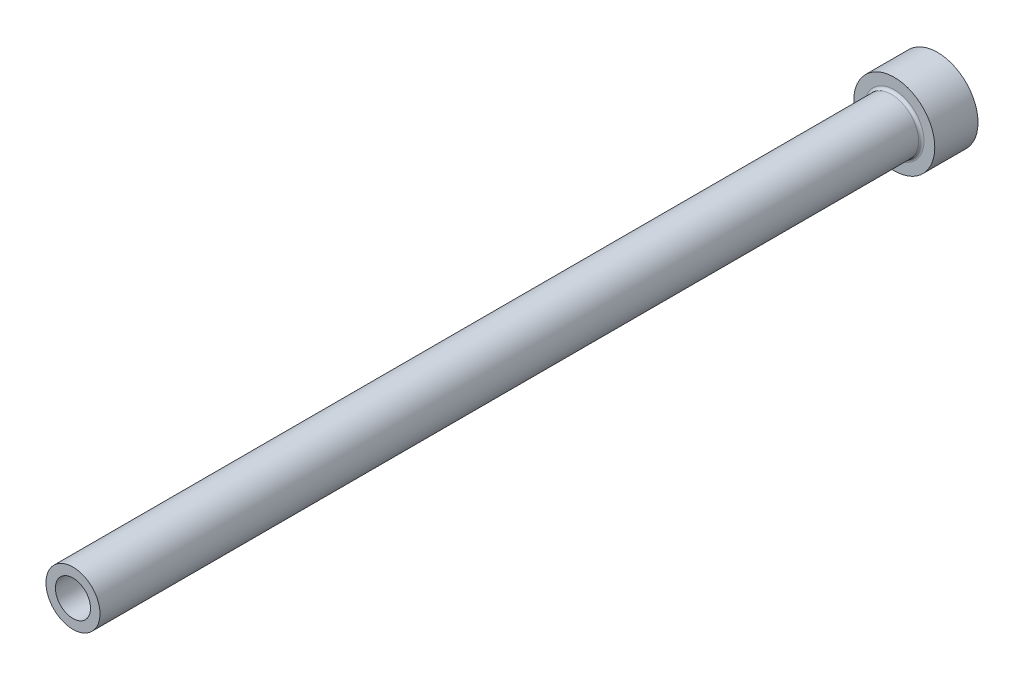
ISO-10303-21;
HEADER;
FILE_DESCRIPTION(('STEP AP214'),'2;1');
FILE_NAME('part.step','',(''),(''),'','','');
FILE_SCHEMA(('AUTOMOTIVE_DESIGN { 1 0 10303 214 1 1 1 1 }'));
ENDSEC;
DATA;
#1=APPLICATION_CONTEXT('core data for automotive mechanical design processes');
#2=APPLICATION_PROTOCOL_DEFINITION('international standard','automotive_design',2000,#1);
#3=PRODUCT_CONTEXT('',#1,'mechanical');
#4=PRODUCT('Part','Part','',(#3));
#5=PRODUCT_RELATED_PRODUCT_CATEGORY('part','',(#4));
#6=PRODUCT_DEFINITION_FORMATION('','',#4);
#7=PRODUCT_DEFINITION_CONTEXT('part definition',#1,'design');
#8=PRODUCT_DEFINITION('design','',#6,#7);
#9=PRODUCT_DEFINITION_SHAPE('','',#8);
#10=(LENGTH_UNIT() NAMED_UNIT(*) SI_UNIT(.MILLI.,.METRE.));
#11=(NAMED_UNIT(*) PLANE_ANGLE_UNIT() SI_UNIT($,.RADIAN.));
#12=(NAMED_UNIT(*) SI_UNIT($,.STERADIAN.) SOLID_ANGLE_UNIT());
#13=UNCERTAINTY_MEASURE_WITH_UNIT(LENGTH_MEASURE(1.E-05),#10,'distance_accuracy_value','');
#14=(GEOMETRIC_REPRESENTATION_CONTEXT(3) GLOBAL_UNCERTAINTY_ASSIGNED_CONTEXT((#13)) GLOBAL_UNIT_ASSIGNED_CONTEXT((#10,
#11,#12)) REPRESENTATION_CONTEXT('',''));
#15=CARTESIAN_POINT('',(0.,0.,0.));
#16=DIRECTION('',(0.,0.,1.));
#17=DIRECTION('',(1.,0.,0.));
#18=AXIS2_PLACEMENT_3D('',#15,#16,#17);
#19=CARTESIAN_POINT('',(0.,0.,160.));
#20=DIRECTION('',(0.,0.,-1.));
#21=DIRECTION('',(-1.,0.,0.));
#22=AXIS2_PLACEMENT_3D('',#19,#20,#21);
#23=PLANE('',#22);
#24=CARTESIAN_POINT('',(0.,0.,160.));
#25=DIRECTION('',(0.,0.,1.));
#26=DIRECTION('',(1.,0.,0.));
#27=AXIS2_PLACEMENT_3D('',#24,#25,#26);
#28=CIRCLE('',#27,3.24999999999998);
#29=CARTESIAN_POINT('',(3.24999999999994,0.,160.));
#30=VERTEX_POINT('',#29);
#31=EDGE_CURVE('E63',#30,#30,#28,.T.);
#32=ORIENTED_EDGE('',*,*,#31,.F.);
#33=EDGE_LOOP('',(#32));
#34=FACE_BOUND('',#33,.T.);
#35=CARTESIAN_POINT('',(0.,0.,160.));
#36=DIRECTION('',(0.,0.,1.));
#37=DIRECTION('',(1.,0.,0.));
#38=AXIS2_PLACEMENT_3D('',#35,#36,#37);
#39=CIRCLE('',#38,4.99999999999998);
#40=CARTESIAN_POINT('',(4.99999999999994,0.,160.));
#41=VERTEX_POINT('',#40);
#42=EDGE_CURVE('E54',#41,#41,#39,.T.);
#43=ORIENTED_EDGE('',*,*,#42,.T.);
#44=EDGE_LOOP('',(#43));
#45=FACE_BOUND('',#44,.T.);
#46=ADVANCED_FACE('F34',(#34,#45),#23,.F.);
#47=CARTESIAN_POINT('',(0.,0.,160.));
#48=DIRECTION('',(0.,0.,1.));
#49=DIRECTION('',(1.,0.,0.));
#50=AXIS2_PLACEMENT_3D('',#47,#48,#49);
#51=CYLINDRICAL_SURFACE('',#50,4.99999999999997);
#52=CARTESIAN_POINT('',(0.,0.,8.50000000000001));
#53=DIRECTION('',(0.,0.,1.));
#54=DIRECTION('',(1.,0.,0.));
#55=AXIS2_PLACEMENT_3D('',#52,#53,#54);
#56=CIRCLE('',#55,4.99999999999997);
#57=CARTESIAN_POINT('',(4.99999999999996,0.,8.50000000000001));
#58=VERTEX_POINT('',#57);
#59=EDGE_CURVE('E49',#58,#58,#56,.T.);
#60=ORIENTED_EDGE('',*,*,#59,.T.);
#61=EDGE_LOOP('',(#60));
#62=FACE_BOUND('',#61,.T.);
#63=ORIENTED_EDGE('',*,*,#42,.F.);
#64=EDGE_LOOP('',(#63));
#65=FACE_BOUND('',#64,.T.);
#66=ADVANCED_FACE('F92',(#62,#65),#51,.T.);
#67=CARTESIAN_POINT('',(0.,0.,7.99999999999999));
#68=DIRECTION('',(0.,0.,1.));
#69=DIRECTION('',(1.,0.,0.));
#70=AXIS2_PLACEMENT_3D('',#67,#68,#69);
#71=PLANE('',#70);
#72=CARTESIAN_POINT('',(0.,0.,7.99999999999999));
#73=DIRECTION('',(0.,0.,1.));
#74=DIRECTION('',(1.,0.,0.));
#75=AXIS2_PLACEMENT_3D('',#72,#73,#74);
#76=CIRCLE('',#75,5.49999999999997);
#77=CARTESIAN_POINT('',(5.49999999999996,0.,8.));
#78=VERTEX_POINT('',#77);
#79=EDGE_CURVE('E45',#78,#78,#76,.F.);
#80=ORIENTED_EDGE('',*,*,#79,.T.);
#81=EDGE_LOOP('',(#80));
#82=FACE_BOUND('',#81,.T.);
#83=CARTESIAN_POINT('',(0.,0.,8.00000000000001));
#84=DIRECTION('',(0.,0.,1.));
#85=DIRECTION('',(1.,0.,0.));
#86=AXIS2_PLACEMENT_3D('',#83,#84,#85);
#87=CIRCLE('',#86,7.49999999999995);
#88=CARTESIAN_POINT('',(7.49999999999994,0.,8.00000000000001));
#89=VERTEX_POINT('',#88);
#90=EDGE_CURVE('E57',#89,#89,#87,.T.);
#91=ORIENTED_EDGE('',*,*,#90,.T.);
#92=EDGE_LOOP('',(#91));
#93=FACE_BOUND('',#92,.T.);
#94=ADVANCED_FACE('F98',(#82,#93),#71,.T.);
#95=CARTESIAN_POINT('',(0.,0.,160.));
#96=DIRECTION('',(0.,0.,1.));
#97=DIRECTION('',(1.,0.,0.));
#98=AXIS2_PLACEMENT_3D('',#95,#96,#97);
#99=CYLINDRICAL_SURFACE('',#98,7.49999999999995);
#100=ORIENTED_EDGE('',*,*,#90,.F.);
#101=EDGE_LOOP('',(#100));
#102=FACE_BOUND('',#101,.T.);
#103=CARTESIAN_POINT('',(0.,0.,0.));
#104=DIRECTION('',(0.,0.,1.));
#105=DIRECTION('',(1.,0.,0.));
#106=AXIS2_PLACEMENT_3D('',#103,#104,#105);
#107=CIRCLE('',#106,7.49999999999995);
#108=CARTESIAN_POINT('',(7.49999999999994,0.,0.));
#109=VERTEX_POINT('',#108);
#110=EDGE_CURVE('E60',#109,#109,#107,.T.);
#111=ORIENTED_EDGE('',*,*,#110,.T.);
#112=EDGE_LOOP('',(#111));
#113=FACE_BOUND('',#112,.T.);
#114=ADVANCED_FACE('F89',(#102,#113),#99,.T.);
#115=CARTESIAN_POINT('',(0.,0.,0.));
#116=DIRECTION('',(0.,0.,1.));
#117=DIRECTION('',(1.,0.,0.));
#118=AXIS2_PLACEMENT_3D('',#115,#116,#117);
#119=PLANE('',#118);
#120=CARTESIAN_POINT('',(0.,0.,0.));
#121=DIRECTION('',(0.,0.,1.));
#122=DIRECTION('',(1.,0.,0.));
#123=AXIS2_PLACEMENT_3D('',#120,#121,#122);
#124=CIRCLE('',#123,4.);
#125=CARTESIAN_POINT('',(3.99999999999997,0.,0.));
#126=VERTEX_POINT('',#125);
#127=EDGE_CURVE('E41',#126,#126,#124,.T.);
#128=ORIENTED_EDGE('',*,*,#127,.T.);
#129=EDGE_LOOP('',(#128));
#130=FACE_BOUND('',#129,.T.);
#131=ORIENTED_EDGE('',*,*,#110,.F.);
#132=EDGE_LOOP('',(#131));
#133=FACE_BOUND('',#132,.T.);
#134=ADVANCED_FACE('F83',(#130,#133),#119,.F.);
#135=CARTESIAN_POINT('',(0.,0.,160.));
#136=DIRECTION('',(0.,0.,1.));
#137=DIRECTION('',(1.,0.,0.));
#138=AXIS2_PLACEMENT_3D('',#135,#136,#137);
#139=CYLINDRICAL_SURFACE('',#138,3.24999999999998);
#140=ORIENTED_EDGE('',*,*,#31,.T.);
#141=EDGE_LOOP('',(#140));
#142=FACE_BOUND('',#141,.T.);
#143=CARTESIAN_POINT('',(0.,0.,85.));
#144=DIRECTION('',(0.,0.,1.));
#145=DIRECTION('',(1.,0.,0.));
#146=AXIS2_PLACEMENT_3D('',#143,#144,#145);
#147=CIRCLE('',#146,3.24999999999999);
#148=CARTESIAN_POINT('',(3.24999999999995,0.,85.));
#149=VERTEX_POINT('',#148);
#150=EDGE_CURVE('E66',#149,#149,#147,.T.);
#151=ORIENTED_EDGE('',*,*,#150,.F.);
#152=EDGE_LOOP('',(#151));
#153=FACE_BOUND('',#152,.T.);
#154=ADVANCED_FACE('F78',(#142,#153),#139,.F.);
#155=CARTESIAN_POINT('',(0.,0.,85.));
#156=DIRECTION('',(0.,0.,-1.));
#157=DIRECTION('',(-1.,0.,0.));
#158=AXIS2_PLACEMENT_3D('',#155,#156,#157);
#159=CONICAL_SURFACE('',#158,3.24999999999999,0.523598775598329);
#160=CARTESIAN_POINT('',(0.,0.,84.5669872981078));
#161=DIRECTION('',(0.,0.,1.));
#162=DIRECTION('',(1.,0.,0.));
#163=AXIS2_PLACEMENT_3D('',#160,#161,#162);
#164=CIRCLE('',#163,3.49999999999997);
#165=CARTESIAN_POINT('',(3.49999999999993,0.,84.5669872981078));
#166=VERTEX_POINT('',#165);
#167=EDGE_CURVE('E69',#166,#166,#164,.T.);
#168=ORIENTED_EDGE('',*,*,#167,.F.);
#169=EDGE_LOOP('',(#168));
#170=FACE_BOUND('',#169,.T.);
#171=ORIENTED_EDGE('',*,*,#150,.T.);
#172=EDGE_LOOP('',(#171));
#173=FACE_BOUND('',#172,.T.);
#174=ADVANCED_FACE('F75',(#170,#173),#159,.F.);
#175=CARTESIAN_POINT('',(0.,0.,160.));
#176=DIRECTION('',(0.,0.,1.));
#177=DIRECTION('',(1.,0.,0.));
#178=AXIS2_PLACEMENT_3D('',#175,#176,#177);
#179=CYLINDRICAL_SURFACE('',#178,3.49999999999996);
#180=CARTESIAN_POINT('',(0.,0.,0.500000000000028));
#181=DIRECTION('',(0.,0.,1.));
#182=DIRECTION('',(1.,0.,0.));
#183=AXIS2_PLACEMENT_3D('',#180,#181,#182);
#184=CIRCLE('',#183,3.49999999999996);
#185=CARTESIAN_POINT('',(3.49999999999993,0.,0.500000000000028));
#186=VERTEX_POINT('',#185);
#187=EDGE_CURVE('E10',#186,#186,#184,.F.);
#188=ORIENTED_EDGE('',*,*,#187,.T.);
#189=EDGE_LOOP('',(#188));
#190=FACE_BOUND('',#189,.T.);
#191=ORIENTED_EDGE('',*,*,#167,.T.);
#192=EDGE_LOOP('',(#191));
#193=FACE_BOUND('',#192,.T.);
#194=ADVANCED_FACE('F73',(#190,#193),#179,.F.);
#195=CARTESIAN_POINT('',(0.,0.,8.50000000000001));
#196=DIRECTION('',(0.,0.,1.));
#197=DIRECTION('',(1.,0.,0.));
#198=AXIS2_PLACEMENT_3D('',#195,#196,#197);
#199=TOROIDAL_SURFACE('',#198,5.49999999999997,0.5);
#200=ORIENTED_EDGE('',*,*,#79,.F.);
#201=EDGE_LOOP('',(#200));
#202=FACE_BOUND('',#201,.T.);
#203=ORIENTED_EDGE('',*,*,#59,.F.);
#204=EDGE_LOOP('',(#203));
#205=FACE_BOUND('',#204,.T.);
#206=ADVANCED_FACE('F104',(#202,#205),#199,.F.);
#207=CARTESIAN_POINT('',(0.,0.,0.));
#208=DIRECTION('',(0.,0.,-1.));
#209=DIRECTION('',(-1.,0.,0.));
#210=AXIS2_PLACEMENT_3D('',#207,#208,#209);
#211=CONICAL_SURFACE('',#210,4.,0.785398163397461);
#212=ORIENTED_EDGE('',*,*,#187,.F.);
#213=EDGE_LOOP('',(#212));
#214=FACE_BOUND('',#213,.T.);
#215=ORIENTED_EDGE('',*,*,#127,.F.);
#216=EDGE_LOOP('',(#215));
#217=FACE_BOUND('',#216,.T.);
#218=ADVANCED_FACE('F36',(#214,#217),#211,.F.);
#219=CLOSED_SHELL('',(#46,#66,#94,#114,#134,#154,#174,#194,#206,#218));
#220=MANIFOLD_SOLID_BREP('B2',#219);
#221=ADVANCED_BREP_SHAPE_REPRESENTATION('',(#18,#220),#14);
#222=SHAPE_DEFINITION_REPRESENTATION(#9,#221);
ENDSEC;
END-ISO-10303-21;
